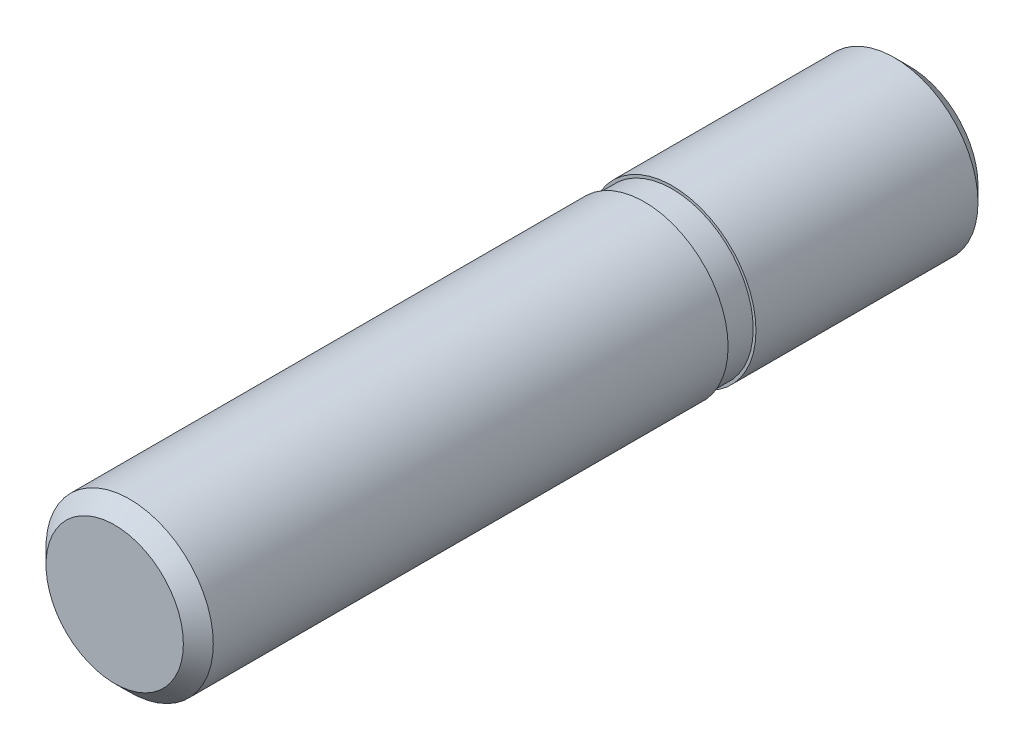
ISO-10303-21;
HEADER;
FILE_DESCRIPTION(('STEP AP214'),'2;1');
FILE_NAME('part.step','',(''),(''),'','','');
FILE_SCHEMA(('AUTOMOTIVE_DESIGN { 1 0 10303 214 1 1 1 1 }'));
ENDSEC;
DATA;
#1=APPLICATION_CONTEXT('core data for automotive mechanical design processes');
#2=APPLICATION_PROTOCOL_DEFINITION('international standard','automotive_design',2000,#1);
#3=PRODUCT_CONTEXT('',#1,'mechanical');
#4=PRODUCT('Part','Part','',(#3));
#5=PRODUCT_RELATED_PRODUCT_CATEGORY('part','',(#4));
#6=PRODUCT_DEFINITION_FORMATION('','',#4);
#7=PRODUCT_DEFINITION_CONTEXT('part definition',#1,'design');
#8=PRODUCT_DEFINITION('design','',#6,#7);
#9=PRODUCT_DEFINITION_SHAPE('','',#8);
#10=(LENGTH_UNIT() NAMED_UNIT(*) SI_UNIT(.MILLI.,.METRE.));
#11=(NAMED_UNIT(*) PLANE_ANGLE_UNIT() SI_UNIT($,.RADIAN.));
#12=(NAMED_UNIT(*) SI_UNIT($,.STERADIAN.) SOLID_ANGLE_UNIT());
#13=UNCERTAINTY_MEASURE_WITH_UNIT(LENGTH_MEASURE(1.E-05),#10,'distance_accuracy_value','');
#14=(GEOMETRIC_REPRESENTATION_CONTEXT(3) GLOBAL_UNCERTAINTY_ASSIGNED_CONTEXT((#13)) GLOBAL_UNIT_ASSIGNED_CONTEXT((#10,
#11,#12)) REPRESENTATION_CONTEXT('',''));
#15=CARTESIAN_POINT('',(0.,0.,0.));
#16=DIRECTION('',(0.,0.,1.));
#17=DIRECTION('',(1.,0.,0.));
#18=AXIS2_PLACEMENT_3D('',#15,#16,#17);
#19=CARTESIAN_POINT('',(0.,2.46325,-17.));
#20=DIRECTION('',(0.,0.,-1.));
#21=DIRECTION('',(-1.,0.,0.));
#22=AXIS2_PLACEMENT_3D('',#19,#20,#21);
#23=PLANE('',#22);
#24=CARTESIAN_POINT('',(0.,0.,-17.0000000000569));
#25=DIRECTION('',(0.,0.,1.));
#26=DIRECTION('',(1.,0.,0.));
#27=AXIS2_PLACEMENT_3D('',#24,#25,#26);
#28=CIRCLE('',#27,4.92649999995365);
#29=CARTESIAN_POINT('',(4.92649999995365,0.,-17.0000000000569));
#30=VERTEX_POINT('',#29);
#31=EDGE_CURVE('E19',#30,#30,#28,.T.);
#32=ORIENTED_EDGE('',*,*,#31,.F.);
#33=EDGE_LOOP('',(#32));
#34=FACE_BOUND('',#33,.T.);
#35=ADVANCED_FACE('F12',(#34),#23,.T.);
#36=CARTESIAN_POINT('',(0.,0.,-15.9264999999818));
#37=DIRECTION('',(0.,0.,1.));
#38=DIRECTION('',(1.,0.,0.));
#39=AXIS2_PLACEMENT_3D('',#36,#37,#38);
#40=CONICAL_SURFACE('',#39,6.00000000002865,0.785398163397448);
#41=CARTESIAN_POINT('',(0.,0.,-15.9265));
#42=DIRECTION('',(0.,0.,1.));
#43=DIRECTION('',(1.,0.,0.));
#44=AXIS2_PLACEMENT_3D('',#41,#42,#43);
#45=CIRCLE('',#44,6.);
#46=CARTESIAN_POINT('',(6.,0.,-15.9265));
#47=VERTEX_POINT('',#46);
#48=EDGE_CURVE('E23',#47,#47,#45,.T.);
#49=ORIENTED_EDGE('',*,*,#48,.F.);
#50=EDGE_LOOP('',(#49));
#51=FACE_BOUND('',#50,.T.);
#52=ORIENTED_EDGE('',*,*,#31,.T.);
#53=EDGE_LOOP('',(#52));
#54=FACE_BOUND('',#53,.T.);
#55=ADVANCED_FACE('F65',(#51,#54),#40,.T.);
#56=CARTESIAN_POINT('',(0.,0.,7.5));
#57=DIRECTION('',(0.,0.,1.));
#58=DIRECTION('',(1.,0.,0.));
#59=AXIS2_PLACEMENT_3D('',#56,#57,#58);
#60=CYLINDRICAL_SURFACE('',#59,6.);
#61=CARTESIAN_POINT('',(0.,0.,0.));
#62=DIRECTION('',(0.,0.,1.));
#63=DIRECTION('',(1.,0.,0.));
#64=AXIS2_PLACEMENT_3D('',#61,#62,#63);
#65=CIRCLE('',#64,6.);
#66=CARTESIAN_POINT('',(6.,0.,0.));
#67=VERTEX_POINT('',#66);
#68=EDGE_CURVE('E28',#67,#67,#65,.T.);
#69=ORIENTED_EDGE('',*,*,#68,.F.);
#70=EDGE_LOOP('',(#69));
#71=FACE_BOUND('',#70,.T.);
#72=ORIENTED_EDGE('',*,*,#48,.T.);
#73=EDGE_LOOP('',(#72));
#74=FACE_BOUND('',#73,.T.);
#75=ADVANCED_FACE('F70',(#71,#74),#60,.T.);
#76=CARTESIAN_POINT('',(0.,0.,0.));
#77=DIRECTION('',(0.,0.,1.));
#78=DIRECTION('',(1.,0.,0.));
#79=AXIS2_PLACEMENT_3D('',#76,#77,#78);
#80=PLANE('',#79);
#81=CARTESIAN_POINT('',(0.,0.,0.));
#82=DIRECTION('',(0.,0.,1.));
#83=DIRECTION('',(1.,0.,0.));
#84=AXIS2_PLACEMENT_3D('',#81,#82,#83);
#85=CIRCLE('',#84,5.8);
#86=CARTESIAN_POINT('',(5.8,0.,0.));
#87=VERTEX_POINT('',#86);
#88=EDGE_CURVE('E8',#87,#87,#85,.T.);
#89=ORIENTED_EDGE('',*,*,#88,.F.);
#90=EDGE_LOOP('',(#89));
#91=FACE_BOUND('',#90,.T.);
#92=ORIENTED_EDGE('',*,*,#68,.T.);
#93=EDGE_LOOP('',(#92));
#94=FACE_BOUND('',#93,.T.);
#95=ADVANCED_FACE('F75',(#91,#94),#80,.T.);
#96=CARTESIAN_POINT('',(0.,0.,-3.42651078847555));
#97=DIRECTION('',(0.,0.,-1.));
#98=DIRECTION('',(-1.,0.,0.));
#99=AXIS2_PLACEMENT_3D('',#96,#97,#98);
#100=CYLINDRICAL_SURFACE('',#99,5.8);
#101=CARTESIAN_POINT('',(0.,0.,2.));
#102=DIRECTION('',(0.,0.,-1.));
#103=DIRECTION('',(-1.,0.,0.));
#104=AXIS2_PLACEMENT_3D('',#101,#102,#103);
#105=CIRCLE('',#104,5.8);
#106=CARTESIAN_POINT('',(-5.8,0.,2.));
#107=VERTEX_POINT('',#106);
#108=EDGE_CURVE('E44',#107,#107,#105,.T.);
#109=ORIENTED_EDGE('',*,*,#108,.T.);
#110=EDGE_LOOP('',(#109));
#111=FACE_BOUND('',#110,.T.);
#112=ORIENTED_EDGE('',*,*,#88,.T.);
#113=EDGE_LOOP('',(#112));
#114=FACE_BOUND('',#113,.T.);
#115=ADVANCED_FACE('F51',(#111,#114),#100,.T.);
#116=CARTESIAN_POINT('',(0.,0.,40.));
#117=DIRECTION('',(0.,0.,1.));
#118=DIRECTION('',(1.,0.,0.));
#119=AXIS2_PLACEMENT_3D('',#116,#117,#118);
#120=PLANE('',#119);
#121=CARTESIAN_POINT('',(0.,0.,40.));
#122=DIRECTION('',(0.,0.,1.));
#123=DIRECTION('',(1.,0.,0.));
#124=AXIS2_PLACEMENT_3D('',#121,#122,#123);
#125=CIRCLE('',#124,4.9265);
#126=CARTESIAN_POINT('',(4.9265,0.,40.));
#127=VERTEX_POINT('',#126);
#128=EDGE_CURVE('E40',#127,#127,#125,.T.);
#129=ORIENTED_EDGE('',*,*,#128,.T.);
#130=EDGE_LOOP('',(#129));
#131=FACE_BOUND('',#130,.T.);
#132=ADVANCED_FACE('F82',(#131),#120,.T.);
#133=CARTESIAN_POINT('',(0.,0.,40.));
#134=DIRECTION('',(0.,0.,-1.));
#135=DIRECTION('',(-1.,0.,0.));
#136=AXIS2_PLACEMENT_3D('',#133,#134,#135);
#137=CONICAL_SURFACE('',#136,4.9265,0.785398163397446);
#138=CARTESIAN_POINT('',(0.,0.,38.9265));
#139=DIRECTION('',(0.,0.,1.));
#140=DIRECTION('',(1.,0.,0.));
#141=AXIS2_PLACEMENT_3D('',#138,#139,#140);
#142=CIRCLE('',#141,6.);
#143=CARTESIAN_POINT('',(6.,0.,38.9265));
#144=VERTEX_POINT('',#143);
#145=EDGE_CURVE('E31',#144,#144,#142,.F.);
#146=ORIENTED_EDGE('',*,*,#145,.F.);
#147=EDGE_LOOP('',(#146));
#148=FACE_BOUND('',#147,.T.);
#149=ORIENTED_EDGE('',*,*,#128,.F.);
#150=EDGE_LOOP('',(#149));
#151=FACE_BOUND('',#150,.T.);
#152=ADVANCED_FACE('F61',(#148,#151),#137,.T.);
#153=CARTESIAN_POINT('',(0.,0.,7.5));
#154=DIRECTION('',(0.,0.,1.));
#155=DIRECTION('',(1.,0.,0.));
#156=AXIS2_PLACEMENT_3D('',#153,#154,#155);
#157=CYLINDRICAL_SURFACE('',#156,6.);
#158=CARTESIAN_POINT('',(0.,0.,2.));
#159=DIRECTION('',(0.,0.,1.));
#160=DIRECTION('',(1.,0.,0.));
#161=AXIS2_PLACEMENT_3D('',#158,#159,#160);
#162=CIRCLE('',#161,6.);
#163=CARTESIAN_POINT('',(6.,0.,2.));
#164=VERTEX_POINT('',#163);
#165=EDGE_CURVE('E35',#164,#164,#162,.T.);
#166=ORIENTED_EDGE('',*,*,#165,.T.);
#167=EDGE_LOOP('',(#166));
#168=FACE_BOUND('',#167,.T.);
#169=ORIENTED_EDGE('',*,*,#145,.T.);
#170=EDGE_LOOP('',(#169));
#171=FACE_BOUND('',#170,.T.);
#172=ADVANCED_FACE('F14',(#168,#171),#157,.T.);
#173=CARTESIAN_POINT('',(0.,0.,2.));
#174=DIRECTION('',(0.,0.,1.));
#175=DIRECTION('',(1.,0.,0.));
#176=AXIS2_PLACEMENT_3D('',#173,#174,#175);
#177=PLANE('',#176);
#178=ORIENTED_EDGE('',*,*,#108,.F.);
#179=EDGE_LOOP('',(#178));
#180=FACE_BOUND('',#179,.T.);
#181=ORIENTED_EDGE('',*,*,#165,.F.);
#182=EDGE_LOOP('',(#181));
#183=FACE_BOUND('',#182,.T.);
#184=ADVANCED_FACE('F53',(#180,#183),#177,.F.);
#185=CLOSED_SHELL('',(#35,#55,#75,#95,#115,#132,#152,#172,#184));
#186=MANIFOLD_SOLID_BREP('B1',#185);
#187=ADVANCED_BREP_SHAPE_REPRESENTATION('',(#18,#186),#14);
#188=SHAPE_DEFINITION_REPRESENTATION(#9,#187);
ENDSEC;
END-ISO-10303-21;
